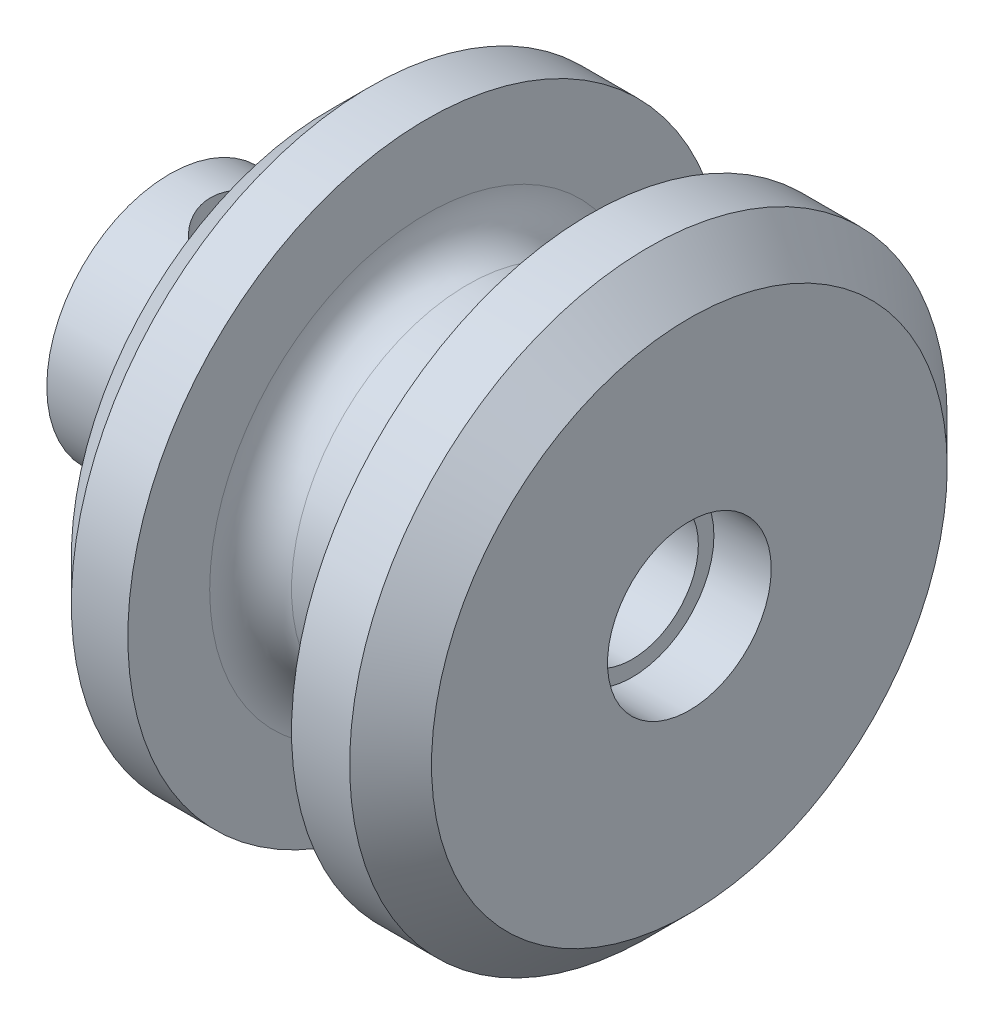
from build123d import *

# Parameters (mm, degrees)
ENL_V_MAT_EXTRU_1_DEPTH      = 17.366734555
ENL_V_MAT_EXTRU_1_DEPTH_BACK = 17.366734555
ESQUISSE3_R                  = 1.3


with BuildPart() as part:
    # Esquisse1 → Base-R_volution (revolve)
    with BuildSketch(Plane.XY, mode=Mode.PRIVATE) as base_r_volution_sk:
        with BuildLine():
            Line((0, 0), (0, 3))
            Line((0, 3), (2.5, 3))
            Line((2.5, 3), (3.9, 4.4))
            Line((3.9, 4.4), (3.9, 6.3))
            Line((3.9, 6.3), (4.9, 7.3))
            Line((4.9, 7.3), (6.28, 7.3))
            Line((6.28, 7.3), (6.28, 5.3))
            ThreePointArc((6.28, 5.3), (6.572893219, 4.592893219), (7.28, 4.3))
            Line((7.28, 4.3), (9.28, 4.3))
            ThreePointArc((9.28, 4.3), (9.987106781, 4.592893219), (10.28, 5.3))
            Line((10.28, 5.3), (10.28, 7.3))
            Line((10.28, 7.3), (11.7, 7.3))
            Line((11.7, 7.3), (12.7, 6.3))
            Line((12.7, 6.3), (12.7, 0))
            Line((12.7, 0), (0, 0))
        make_face()
    revolve(base_r_volution_sk.sketch.rotate(Axis((0, 0, 0), (-1, 0, 0)), 90), axis=Axis((0, 0, 0), (-1, 0, 0)))

    # Esquisse2 → Enl_vement de mati_re-R_volution1 (revolve, cut)
    with BuildSketch(Plane.XY, mode=Mode.PRIVATE) as enl_vement_de_mati_re_r_volution1_sk:
        Polygon((0, 0), (0, 1.62), (11.3, 1.62), (11.3, 2), (12.7, 2), (12.7, 0), align=None)
    revolve(enl_vement_de_mati_re_r_volution1_sk.sketch.rotate(Axis((0, 0, 0), (-1, 0, 0)), 90), axis=Axis((0, 0, 0), (-1, 0, 0)), mode=Mode.SUBTRACT)

    # Esquisse3 → Enl_v. mat.-Extru.1 (cut, two sides: drawn at the far end of the back side and taken through both)
    with BuildSketch(Plane(origin=(0, 0, 0), x_dir=(1, 0, 0), z_dir=(0, 1, 0)).offset(-ENL_V_MAT_EXTRU_1_DEPTH_BACK)):
        with Locations(Location((2.3, 0, 0), (0, 0, 270))):
            Circle(ESQUISSE3_R)
    extrude(amount=ENL_V_MAT_EXTRU_1_DEPTH + ENL_V_MAT_EXTRU_1_DEPTH_BACK, mode=Mode.SUBTRACT)


solid = part.part
